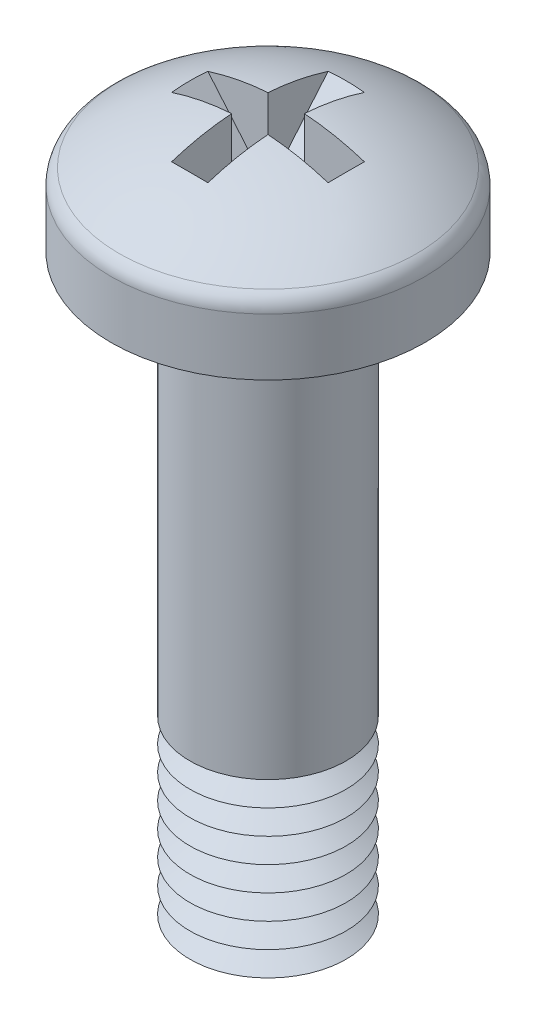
ISO-10303-21;
HEADER;
FILE_DESCRIPTION(('STEP AP214'),'2;1');
FILE_NAME('part.step','',(''),(''),'','','');
FILE_SCHEMA(('AUTOMOTIVE_DESIGN { 1 0 10303 214 1 1 1 1 }'));
ENDSEC;
DATA;
#1=APPLICATION_CONTEXT('core data for automotive mechanical design processes');
#2=APPLICATION_PROTOCOL_DEFINITION('international standard','automotive_design',2000,#1);
#3=PRODUCT_CONTEXT('',#1,'mechanical');
#4=PRODUCT('Part','Part','',(#3));
#5=PRODUCT_RELATED_PRODUCT_CATEGORY('part','',(#4));
#6=PRODUCT_DEFINITION_FORMATION('','',#4);
#7=PRODUCT_DEFINITION_CONTEXT('part definition',#1,'design');
#8=PRODUCT_DEFINITION('design','',#6,#7);
#9=PRODUCT_DEFINITION_SHAPE('','',#8);
#10=(LENGTH_UNIT() NAMED_UNIT(*) SI_UNIT(.MILLI.,.METRE.));
#11=(NAMED_UNIT(*) PLANE_ANGLE_UNIT() SI_UNIT($,.RADIAN.));
#12=(NAMED_UNIT(*) SI_UNIT($,.STERADIAN.) SOLID_ANGLE_UNIT());
#13=UNCERTAINTY_MEASURE_WITH_UNIT(LENGTH_MEASURE(1.E-05),#10,'distance_accuracy_value','');
#14=(GEOMETRIC_REPRESENTATION_CONTEXT(3) GLOBAL_UNCERTAINTY_ASSIGNED_CONTEXT((#13)) GLOBAL_UNIT_ASSIGNED_CONTEXT((#10,
#11,#12)) REPRESENTATION_CONTEXT('',''));
#15=CARTESIAN_POINT('',(0.,0.,0.));
#16=DIRECTION('',(0.,0.,1.));
#17=DIRECTION('',(1.,0.,0.));
#18=AXIS2_PLACEMENT_3D('',#15,#16,#17);
#19=CARTESIAN_POINT('',(2.285,3.1,-0.465));
#20=DIRECTION('',(0.76333266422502,-0.646005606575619,0.));
#21=DIRECTION('',(0.646005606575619,0.76333266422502,0.));
#22=AXIS2_PLACEMENT_3D('',#19,#20,#21);
#23=PLANE('',#22);
#24=DIRECTION('',(0.,0.,-1.));
#25=VECTOR('',#24,1.);
#26=CARTESIAN_POINT('',(0.465,0.94945295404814,-0.465));
#27=LINE('',#26,#25);
#28=CARTESIAN_POINT('',(0.465,0.94945295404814,0.465));
#29=VERTEX_POINT('',#28);
#30=CARTESIAN_POINT('',(0.465,0.94945295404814,-0.465));
#31=VERTEX_POINT('',#30);
#32=EDGE_CURVE('E137',#29,#31,#27,.T.);
#33=ORIENTED_EDGE('',*,*,#32,.F.);
#34=DIRECTION('',(0.646005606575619,0.76333266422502,0.));
#35=VECTOR('',#34,1.);
#36=CARTESIAN_POINT('',(2.285,3.1,0.465));
#37=LINE('',#36,#35);
#38=CARTESIAN_POINT('',(2.00334390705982,2.76718973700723,0.465));
#39=VERTEX_POINT('',#38);
#40=EDGE_CURVE('E178',#29,#39,#37,.T.);
#41=ORIENTED_EDGE('',*,*,#40,.T.);
#42=CARTESIAN_POINT('',(-1.8840992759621,-1.82628798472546,0.));
#43=DIRECTION('',(0.76333266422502,-0.646005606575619,0.));
#44=DIRECTION('',(0.646005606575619,0.76333266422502,0.));
#45=AXIS2_PLACEMENT_3D('',#42,#43,#44);
#46=CIRCLE('',#45,6.03560080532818);
#47=CARTESIAN_POINT('',(2.00334390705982,2.76718973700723,-0.465));
#48=VERTEX_POINT('',#47);
#49=EDGE_CURVE('E259',#39,#48,#46,.F.);
#50=ORIENTED_EDGE('',*,*,#49,.T.);
#51=DIRECTION('',(0.646005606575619,0.76333266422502,0.));
#52=VECTOR('',#51,1.);
#53=CARTESIAN_POINT('',(2.285,3.1,-0.465));
#54=LINE('',#53,#52);
#55=EDGE_CURVE('E184',#31,#48,#54,.T.);
#56=ORIENTED_EDGE('',*,*,#55,.F.);
#57=EDGE_LOOP('',(#33,#41,#50,#56));
#58=FACE_BOUND('',#57,.T.);
#59=ADVANCED_FACE('F31',(#58),#23,.F.);
#60=CARTESIAN_POINT('',(-2.285,4.65,-0.465));
#61=DIRECTION('',(0.,0.,-1.));
#62=DIRECTION('',(-1.,0.,0.));
#63=AXIS2_PLACEMENT_3D('',#60,#61,#62);
#64=PLANE('',#63);
#65=DIRECTION('',(0.646005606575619,-0.76333266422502,0.));
#66=VECTOR('',#65,1.);
#67=CARTESIAN_POINT('',(0.,0.4,-0.465));
#68=LINE('',#67,#66);
#69=CARTESIAN_POINT('',(-2.00334390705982,2.76718973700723,-0.465));
#70=VERTEX_POINT('',#69);
#71=CARTESIAN_POINT('',(-0.465,0.94945295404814,-0.465));
#72=VERTEX_POINT('',#71);
#73=EDGE_CURVE('E182',#70,#72,#68,.T.);
#74=ORIENTED_EDGE('',*,*,#73,.T.);
#75=DIRECTION('',(0.,1.,0.));
#76=VECTOR('',#75,1.);
#77=CARTESIAN_POINT('',(-0.465,4.65,-0.465));
#78=LINE('',#77,#76);
#79=CARTESIAN_POINT('',(-0.465,3.06675595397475,-0.465));
#80=VERTEX_POINT('',#79);
#81=EDGE_CURVE('E158',#72,#80,#78,.T.);
#82=ORIENTED_EDGE('',*,*,#81,.T.);
#83=CARTESIAN_POINT('',(0.,-3.42079422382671,-0.465));
#84=DIRECTION('',(0.,0.,-1.));
#85=DIRECTION('',(-1.,0.,0.));
#86=AXIS2_PLACEMENT_3D('',#83,#84,#85);
#87=CIRCLE('',#86,6.50419344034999);
#88=EDGE_CURVE('E262',#80,#70,#87,.F.);
#89=ORIENTED_EDGE('',*,*,#88,.T.);
#90=EDGE_LOOP('',(#74,#82,#89));
#91=FACE_BOUND('',#90,.T.);
#92=ADVANCED_FACE('F290',(#91),#64,.F.);
#93=DIRECTION('',(0.,1.,0.));
#94=VECTOR('',#93,1.);
#95=CARTESIAN_POINT('',(0.465,4.65,-0.465));
#96=LINE('',#95,#94);
#97=CARTESIAN_POINT('',(0.465,3.06675595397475,-0.465));
#98=VERTEX_POINT('',#97);
#99=EDGE_CURVE('E150',#31,#98,#96,.T.);
#100=ORIENTED_EDGE('',*,*,#99,.F.);
#101=ORIENTED_EDGE('',*,*,#55,.T.);
#102=EDGE_CURVE('E263',#48,#98,#87,.F.);
#103=ORIENTED_EDGE('',*,*,#102,.T.);
#104=EDGE_LOOP('',(#100,#101,#103));
#105=FACE_BOUND('',#104,.T.);
#106=ADVANCED_FACE('F318',(#105),#64,.F.);
#107=CARTESIAN_POINT('',(-2.285,4.65,0.465));
#108=DIRECTION('',(0.,0.,-1.));
#109=DIRECTION('',(-1.,0.,0.));
#110=AXIS2_PLACEMENT_3D('',#107,#108,#109);
#111=PLANE('',#110);
#112=DIRECTION('',(0.,1.,0.));
#113=VECTOR('',#112,1.);
#114=CARTESIAN_POINT('',(-0.465,4.65,0.465));
#115=LINE('',#114,#113);
#116=CARTESIAN_POINT('',(-0.465,0.94945295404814,0.465));
#117=VERTEX_POINT('',#116);
#118=CARTESIAN_POINT('',(-0.465,3.06675595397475,0.465));
#119=VERTEX_POINT('',#118);
#120=EDGE_CURVE('E39',#117,#119,#115,.T.);
#121=ORIENTED_EDGE('',*,*,#120,.F.);
#122=DIRECTION('',(0.646005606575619,-0.76333266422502,0.));
#123=VECTOR('',#122,1.);
#124=CARTESIAN_POINT('',(0.,0.4,0.465));
#125=LINE('',#124,#123);
#126=CARTESIAN_POINT('',(-2.00334390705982,2.76718973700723,0.465));
#127=VERTEX_POINT('',#126);
#128=EDGE_CURVE('E175',#127,#117,#125,.T.);
#129=ORIENTED_EDGE('',*,*,#128,.F.);
#130=CARTESIAN_POINT('',(0.,-3.42079422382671,0.465));
#131=DIRECTION('',(0.,0.,-1.));
#132=DIRECTION('',(-1.,0.,0.));
#133=AXIS2_PLACEMENT_3D('',#130,#131,#132);
#134=CIRCLE('',#133,6.50419344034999);
#135=EDGE_CURVE('E196',#119,#127,#134,.F.);
#136=ORIENTED_EDGE('',*,*,#135,.F.);
#137=EDGE_LOOP('',(#121,#129,#136));
#138=FACE_BOUND('',#137,.T.);
#139=ADVANCED_FACE('F282',(#138),#111,.T.);
#140=ORIENTED_EDGE('',*,*,#40,.F.);
#141=DIRECTION('',(0.,1.,0.));
#142=VECTOR('',#141,1.);
#143=CARTESIAN_POINT('',(0.465,4.65,0.465));
#144=LINE('',#143,#142);
#145=CARTESIAN_POINT('',(0.465,3.06675595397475,0.465));
#146=VERTEX_POINT('',#145);
#147=EDGE_CURVE('E266',#29,#146,#144,.T.);
#148=ORIENTED_EDGE('',*,*,#147,.T.);
#149=EDGE_CURVE('E253',#39,#146,#134,.F.);
#150=ORIENTED_EDGE('',*,*,#149,.F.);
#151=EDGE_LOOP('',(#140,#148,#150));
#152=FACE_BOUND('',#151,.T.);
#153=ADVANCED_FACE('F323',(#152),#111,.T.);
#154=CARTESIAN_POINT('',(0.,0.,0.));
#155=DIRECTION('',(0.,-1.,0.));
#156=DIRECTION('',(0.,0.,-1.));
#157=AXIS2_PLACEMENT_3D('',#154,#155,#156);
#158=PLANE('',#157);
#159=CARTESIAN_POINT('',(0.,0.,0.));
#160=DIRECTION('',(0.,-1.,0.));
#161=DIRECTION('',(0.,0.,-1.));
#162=AXIS2_PLACEMENT_3D('',#159,#160,#161);
#163=CIRCLE('',#162,2.);
#164=CARTESIAN_POINT('',(0.,0.,-2.));
#165=VERTEX_POINT('',#164);
#166=EDGE_CURVE('E193',#165,#165,#163,.T.);
#167=ORIENTED_EDGE('',*,*,#166,.F.);
#168=EDGE_LOOP('',(#167));
#169=FACE_BOUND('',#168,.T.);
#170=CARTESIAN_POINT('',(0.,0.,0.));
#171=DIRECTION('',(0.,-1.,0.));
#172=DIRECTION('',(0.,0.,-1.));
#173=AXIS2_PLACEMENT_3D('',#170,#171,#172);
#174=CIRCLE('',#173,4.02079422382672);
#175=CARTESIAN_POINT('',(0.,0.,-4.02079422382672));
#176=VERTEX_POINT('',#175);
#177=EDGE_CURVE('E197',#176,#176,#174,.T.);
#178=ORIENTED_EDGE('',*,*,#177,.T.);
#179=EDGE_LOOP('',(#178));
#180=FACE_BOUND('',#179,.T.);
#181=ADVANCED_FACE('F33',(#169,#180),#158,.T.);
#182=CARTESIAN_POINT('',(0.,0.,0.));
#183=DIRECTION('',(0.,-1.,0.));
#184=DIRECTION('',(0.,0.,-1.));
#185=AXIS2_PLACEMENT_3D('',#182,#183,#184);
#186=CYLINDRICAL_SURFACE('',#185,4.02079422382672);
#187=CARTESIAN_POINT('',(0.,1.4628519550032,0.));
#188=DIRECTION('',(0.,-1.,0.));
#189=DIRECTION('',(0.,0.,-1.));
#190=AXIS2_PLACEMENT_3D('',#187,#188,#189);
#191=CIRCLE('',#190,4.02079422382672);
#192=CARTESIAN_POINT('',(0.,1.4628519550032,-4.02079422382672));
#193=VERTEX_POINT('',#192);
#194=EDGE_CURVE('E248',#193,#193,#191,.T.);
#195=ORIENTED_EDGE('',*,*,#194,.T.);
#196=EDGE_LOOP('',(#195));
#197=FACE_BOUND('',#196,.T.);
#198=ORIENTED_EDGE('',*,*,#177,.F.);
#199=EDGE_LOOP('',(#198));
#200=FACE_BOUND('',#199,.T.);
#201=ADVANCED_FACE('F454',(#197,#200),#186,.T.);
#202=CARTESIAN_POINT('',(0.,1.4628519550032,0.));
#203=DIRECTION('',(0.,-1.,0.));
#204=DIRECTION('',(0.,0.,-1.));
#205=AXIS2_PLACEMENT_3D('',#202,#203,#204);
#206=TOROIDAL_SURFACE('',#205,3.52,0.500794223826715);
#207=CARTESIAN_POINT('',(0.,1.86911471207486,0.));
#208=DIRECTION('',(0.,-1.,0.));
#209=DIRECTION('',(0.,0.,-1.));
#210=AXIS2_PLACEMENT_3D('',#207,#208,#209);
#211=CIRCLE('',#210,3.81282320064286);
#212=CARTESIAN_POINT('',(0.,1.86911471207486,-3.81282320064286));
#213=VERTEX_POINT('',#212);
#214=EDGE_CURVE('E245',#213,#213,#211,.T.);
#215=ORIENTED_EDGE('',*,*,#214,.T.);
#216=EDGE_LOOP('',(#215));
#217=FACE_BOUND('',#216,.T.);
#218=ORIENTED_EDGE('',*,*,#194,.F.);
#219=EDGE_LOOP('',(#218));
#220=FACE_BOUND('',#219,.T.);
#221=ADVANCED_FACE('F452',(#217,#220),#206,.T.);
#222=CARTESIAN_POINT('',(0.,-3.42079422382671,0.));
#223=DIRECTION('',(0.,0.,1.));
#224=DIRECTION('',(1.,0.,0.));
#225=AXIS2_PLACEMENT_3D('',#222,#223,#224);
#226=SPHERICAL_SURFACE('',#225,6.52079422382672);
#227=CARTESIAN_POINT('',(-0.465,-3.42079422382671,0.));
#228=DIRECTION('',(-1.,0.,0.));
#229=DIRECTION('',(0.,0.,1.));
#230=AXIS2_PLACEMENT_3D('',#227,#228,#229);
#231=CIRCLE('',#230,6.50419344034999);
#232=CARTESIAN_POINT('',(-0.465,2.76718973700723,-2.00334390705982));
#233=VERTEX_POINT('',#232);
#234=EDGE_CURVE('E159',#233,#80,#231,.F.);
#235=ORIENTED_EDGE('',*,*,#234,.F.);
#236=CARTESIAN_POINT('',(0.,-1.82628798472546,1.8840992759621));
#237=DIRECTION('',(0.,-0.646005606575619,-0.76333266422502));
#238=DIRECTION('',(0.,0.76333266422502,-0.646005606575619));
#239=AXIS2_PLACEMENT_3D('',#236,#237,#238);
#240=CIRCLE('',#239,6.03560080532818);
#241=CARTESIAN_POINT('',(0.465,2.76718973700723,-2.00334390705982));
#242=VERTEX_POINT('',#241);
#243=EDGE_CURVE('E172',#242,#233,#240,.F.);
#244=ORIENTED_EDGE('',*,*,#243,.F.);
#245=CARTESIAN_POINT('',(0.465,-3.42079422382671,0.));
#246=DIRECTION('',(-1.,0.,0.));
#247=DIRECTION('',(0.,0.,1.));
#248=AXIS2_PLACEMENT_3D('',#245,#246,#247);
#249=CIRCLE('',#248,6.50419344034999);
#250=EDGE_CURVE('E151',#242,#98,#249,.F.);
#251=ORIENTED_EDGE('',*,*,#250,.T.);
#252=ORIENTED_EDGE('',*,*,#102,.F.);
#253=ORIENTED_EDGE('',*,*,#49,.F.);
#254=ORIENTED_EDGE('',*,*,#149,.T.);
#255=CARTESIAN_POINT('',(0.465,2.76718973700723,2.00334390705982));
#256=VERTEX_POINT('',#255);
#257=EDGE_CURVE('E147',#146,#256,#249,.F.);
#258=ORIENTED_EDGE('',*,*,#257,.T.);
#259=CARTESIAN_POINT('',(0.,-1.82628798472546,-1.8840992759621));
#260=DIRECTION('',(0.,-0.646005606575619,0.76333266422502));
#261=DIRECTION('',(0.,-0.76333266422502,-0.646005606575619));
#262=AXIS2_PLACEMENT_3D('',#259,#260,#261);
#263=CIRCLE('',#262,6.03560080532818);
#264=CARTESIAN_POINT('',(-0.465,2.76718973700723,2.00334390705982));
#265=VERTEX_POINT('',#264);
#266=EDGE_CURVE('E166',#265,#256,#263,.F.);
#267=ORIENTED_EDGE('',*,*,#266,.F.);
#268=EDGE_CURVE('E156',#119,#265,#231,.F.);
#269=ORIENTED_EDGE('',*,*,#268,.F.);
#270=ORIENTED_EDGE('',*,*,#135,.T.);
#271=CARTESIAN_POINT('',(1.8840992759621,-1.82628798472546,0.));
#272=DIRECTION('',(-0.76333266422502,-0.646005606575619,0.));
#273=DIRECTION('',(0.646005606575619,-0.76333266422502,0.));
#274=AXIS2_PLACEMENT_3D('',#271,#272,#273);
#275=CIRCLE('',#274,6.03560080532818);
#276=EDGE_CURVE('E256',#70,#127,#275,.F.);
#277=ORIENTED_EDGE('',*,*,#276,.F.);
#278=ORIENTED_EDGE('',*,*,#88,.F.);
#279=EDGE_LOOP('',(#235,#244,#251,#252,#253,#254,#258,#267,#269,#270,#277,#278));
#280=FACE_BOUND('',#279,.T.);
#281=ORIENTED_EDGE('',*,*,#214,.F.);
#282=EDGE_LOOP('',(#281));
#283=FACE_BOUND('',#282,.T.);
#284=ADVANCED_FACE('F279',(#280,#283),#226,.T.);
#285=CARTESIAN_POINT('',(0.,-15.,0.));
#286=DIRECTION('',(0.,-1.,0.));
#287=DIRECTION('',(0.,0.,-1.));
#288=AXIS2_PLACEMENT_3D('',#285,#286,#287);
#289=PLANE('',#288);
#290=CARTESIAN_POINT('',(0.,-15.,0.));
#291=DIRECTION('',(0.,-1.,0.));
#292=DIRECTION('',(0.,0.,-1.));
#293=AXIS2_PLACEMENT_3D('',#290,#291,#292);
#294=CIRCLE('',#293,1.45595);
#295=CARTESIAN_POINT('',(0.,-15.,-1.45595));
#296=VERTEX_POINT('',#295);
#297=EDGE_CURVE('E242',#296,#296,#294,.T.);
#298=ORIENTED_EDGE('',*,*,#297,.T.);
#299=EDGE_LOOP('',(#298));
#300=FACE_BOUND('',#299,.T.);
#301=ADVANCED_FACE('F445',(#300),#289,.T.);
#302=CARTESIAN_POINT('',(0.,-15.,0.));
#303=DIRECTION('',(0.,1.,0.));
#304=DIRECTION('',(0.,0.,1.));
#305=AXIS2_PLACEMENT_3D('',#302,#303,#304);
#306=CONICAL_SURFACE('',#305,1.45595,1.0471975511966);
#307=CARTESIAN_POINT('',(0.,-14.6858925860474,0.));
#308=DIRECTION('',(0.,-1.,0.));
#309=DIRECTION('',(0.,0.,-1.));
#310=AXIS2_PLACEMENT_3D('',#307,#308,#309);
#311=CIRCLE('',#310,2.);
#312=CARTESIAN_POINT('',(0.,-14.6858925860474,-2.));
#313=VERTEX_POINT('',#312);
#314=EDGE_CURVE('E239',#313,#313,#311,.T.);
#315=ORIENTED_EDGE('',*,*,#314,.T.);
#316=EDGE_LOOP('',(#315));
#317=FACE_BOUND('',#316,.T.);
#318=ORIENTED_EDGE('',*,*,#297,.F.);
#319=EDGE_LOOP('',(#318));
#320=FACE_BOUND('',#319,.T.);
#321=ADVANCED_FACE('F441',(#317,#320),#306,.T.);
#322=CARTESIAN_POINT('',(0.,-14.6858925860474,0.));
#323=DIRECTION('',(0.,-1.,0.));
#324=DIRECTION('',(0.,0.,-1.));
#325=AXIS2_PLACEMENT_3D('',#322,#323,#324);
#326=CONICAL_SURFACE('',#325,2.,1.0471975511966);
#327=CARTESIAN_POINT('',(0.,-14.3717851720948,0.));
#328=DIRECTION('',(0.,-1.,0.));
#329=DIRECTION('',(0.,0.,-1.));
#330=AXIS2_PLACEMENT_3D('',#327,#328,#329);
#331=CIRCLE('',#330,1.45595);
#332=CARTESIAN_POINT('',(0.,-14.3717851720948,-1.45595));
#333=VERTEX_POINT('',#332);
#334=EDGE_CURVE('E236',#333,#333,#331,.T.);
#335=ORIENTED_EDGE('',*,*,#334,.T.);
#336=EDGE_LOOP('',(#335));
#337=FACE_BOUND('',#336,.T.);
#338=ORIENTED_EDGE('',*,*,#314,.F.);
#339=EDGE_LOOP('',(#338));
#340=FACE_BOUND('',#339,.T.);
#341=ADVANCED_FACE('F437',(#337,#340),#326,.T.);
#342=CARTESIAN_POINT('',(0.,-14.3717851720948,0.));
#343=DIRECTION('',(0.,1.,0.));
#344=DIRECTION('',(0.,0.,1.));
#345=AXIS2_PLACEMENT_3D('',#342,#343,#344);
#346=CONICAL_SURFACE('',#345,1.45595,1.0471975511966);
#347=CARTESIAN_POINT('',(0.,-14.0576777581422,0.));
#348=DIRECTION('',(0.,-1.,0.));
#349=DIRECTION('',(0.,0.,-1.));
#350=AXIS2_PLACEMENT_3D('',#347,#348,#349);
#351=CIRCLE('',#350,2.);
#352=CARTESIAN_POINT('',(0.,-14.0576777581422,-2.));
#353=VERTEX_POINT('',#352);
#354=EDGE_CURVE('E233',#353,#353,#351,.T.);
#355=ORIENTED_EDGE('',*,*,#354,.T.);
#356=EDGE_LOOP('',(#355));
#357=FACE_BOUND('',#356,.T.);
#358=ORIENTED_EDGE('',*,*,#334,.F.);
#359=EDGE_LOOP('',(#358));
#360=FACE_BOUND('',#359,.T.);
#361=ADVANCED_FACE('F433',(#357,#360),#346,.T.);
#362=CARTESIAN_POINT('',(0.,-14.0576777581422,0.));
#363=DIRECTION('',(0.,-1.,0.));
#364=DIRECTION('',(0.,0.,-1.));
#365=AXIS2_PLACEMENT_3D('',#362,#363,#364);
#366=CONICAL_SURFACE('',#365,2.,1.0471975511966);
#367=CARTESIAN_POINT('',(0.,-13.7435703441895,0.));
#368=DIRECTION('',(0.,-1.,0.));
#369=DIRECTION('',(0.,0.,-1.));
#370=AXIS2_PLACEMENT_3D('',#367,#368,#369);
#371=CIRCLE('',#370,1.45595);
#372=CARTESIAN_POINT('',(0.,-13.7435703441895,-1.45595));
#373=VERTEX_POINT('',#372);
#374=EDGE_CURVE('E230',#373,#373,#371,.T.);
#375=ORIENTED_EDGE('',*,*,#374,.T.);
#376=EDGE_LOOP('',(#375));
#377=FACE_BOUND('',#376,.T.);
#378=ORIENTED_EDGE('',*,*,#354,.F.);
#379=EDGE_LOOP('',(#378));
#380=FACE_BOUND('',#379,.T.);
#381=ADVANCED_FACE('F429',(#377,#380),#366,.T.);
#382=CARTESIAN_POINT('',(0.,-13.7435703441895,0.));
#383=DIRECTION('',(0.,1.,0.));
#384=DIRECTION('',(0.,0.,1.));
#385=AXIS2_PLACEMENT_3D('',#382,#383,#384);
#386=CONICAL_SURFACE('',#385,1.45595,1.0471975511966);
#387=CARTESIAN_POINT('',(0.,-13.4294629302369,0.));
#388=DIRECTION('',(0.,-1.,0.));
#389=DIRECTION('',(0.,0.,-1.));
#390=AXIS2_PLACEMENT_3D('',#387,#388,#389);
#391=CIRCLE('',#390,2.);
#392=CARTESIAN_POINT('',(0.,-13.4294629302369,-2.));
#393=VERTEX_POINT('',#392);
#394=EDGE_CURVE('E227',#393,#393,#391,.T.);
#395=ORIENTED_EDGE('',*,*,#394,.T.);
#396=EDGE_LOOP('',(#395));
#397=FACE_BOUND('',#396,.T.);
#398=ORIENTED_EDGE('',*,*,#374,.F.);
#399=EDGE_LOOP('',(#398));
#400=FACE_BOUND('',#399,.T.);
#401=ADVANCED_FACE('F425',(#397,#400),#386,.T.);
#402=CARTESIAN_POINT('',(0.,-13.4294629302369,0.));
#403=DIRECTION('',(0.,-1.,0.));
#404=DIRECTION('',(0.,0.,-1.));
#405=AXIS2_PLACEMENT_3D('',#402,#403,#404);
#406=CONICAL_SURFACE('',#405,2.,1.0471975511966);
#407=CARTESIAN_POINT('',(0.,-13.1153555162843,0.));
#408=DIRECTION('',(0.,-1.,0.));
#409=DIRECTION('',(0.,0.,-1.));
#410=AXIS2_PLACEMENT_3D('',#407,#408,#409);
#411=CIRCLE('',#410,1.45595);
#412=CARTESIAN_POINT('',(0.,-13.1153555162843,-1.45595));
#413=VERTEX_POINT('',#412);
#414=EDGE_CURVE('E224',#413,#413,#411,.T.);
#415=ORIENTED_EDGE('',*,*,#414,.T.);
#416=EDGE_LOOP('',(#415));
#417=FACE_BOUND('',#416,.T.);
#418=ORIENTED_EDGE('',*,*,#394,.F.);
#419=EDGE_LOOP('',(#418));
#420=FACE_BOUND('',#419,.T.);
#421=ADVANCED_FACE('F421',(#417,#420),#406,.T.);
#422=CARTESIAN_POINT('',(0.,-13.1153555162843,0.));
#423=DIRECTION('',(0.,1.,0.));
#424=DIRECTION('',(0.,0.,1.));
#425=AXIS2_PLACEMENT_3D('',#422,#423,#424);
#426=CONICAL_SURFACE('',#425,1.45595,1.0471975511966);
#427=CARTESIAN_POINT('',(0.,-12.8012481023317,0.));
#428=DIRECTION('',(0.,-1.,0.));
#429=DIRECTION('',(0.,0.,-1.));
#430=AXIS2_PLACEMENT_3D('',#427,#428,#429);
#431=CIRCLE('',#430,2.);
#432=CARTESIAN_POINT('',(0.,-12.8012481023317,-2.));
#433=VERTEX_POINT('',#432);
#434=EDGE_CURVE('E221',#433,#433,#431,.T.);
#435=ORIENTED_EDGE('',*,*,#434,.T.);
#436=EDGE_LOOP('',(#435));
#437=FACE_BOUND('',#436,.T.);
#438=ORIENTED_EDGE('',*,*,#414,.F.);
#439=EDGE_LOOP('',(#438));
#440=FACE_BOUND('',#439,.T.);
#441=ADVANCED_FACE('F417',(#437,#440),#426,.T.);
#442=CARTESIAN_POINT('',(0.,-12.8012481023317,0.));
#443=DIRECTION('',(0.,-1.,0.));
#444=DIRECTION('',(0.,0.,-1.));
#445=AXIS2_PLACEMENT_3D('',#442,#443,#444);
#446=CONICAL_SURFACE('',#445,2.,1.0471975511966);
#447=CARTESIAN_POINT('',(0.,-12.4871406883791,0.));
#448=DIRECTION('',(0.,-1.,0.));
#449=DIRECTION('',(0.,0.,-1.));
#450=AXIS2_PLACEMENT_3D('',#447,#448,#449);
#451=CIRCLE('',#450,1.45595);
#452=CARTESIAN_POINT('',(0.,-12.4871406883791,-1.45595));
#453=VERTEX_POINT('',#452);
#454=EDGE_CURVE('E218',#453,#453,#451,.T.);
#455=ORIENTED_EDGE('',*,*,#454,.T.);
#456=EDGE_LOOP('',(#455));
#457=FACE_BOUND('',#456,.T.);
#458=ORIENTED_EDGE('',*,*,#434,.F.);
#459=EDGE_LOOP('',(#458));
#460=FACE_BOUND('',#459,.T.);
#461=ADVANCED_FACE('F413',(#457,#460),#446,.T.);
#462=CARTESIAN_POINT('',(0.,-12.4871406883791,0.));
#463=DIRECTION('',(0.,1.,0.));
#464=DIRECTION('',(0.,0.,1.));
#465=AXIS2_PLACEMENT_3D('',#462,#463,#464);
#466=CONICAL_SURFACE('',#465,1.45595,1.0471975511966);
#467=CARTESIAN_POINT('',(0.,-12.1730332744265,0.));
#468=DIRECTION('',(0.,-1.,0.));
#469=DIRECTION('',(0.,0.,-1.));
#470=AXIS2_PLACEMENT_3D('',#467,#468,#469);
#471=CIRCLE('',#470,2.);
#472=CARTESIAN_POINT('',(0.,-12.1730332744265,-2.));
#473=VERTEX_POINT('',#472);
#474=EDGE_CURVE('E215',#473,#473,#471,.T.);
#475=ORIENTED_EDGE('',*,*,#474,.T.);
#476=EDGE_LOOP('',(#475));
#477=FACE_BOUND('',#476,.T.);
#478=ORIENTED_EDGE('',*,*,#454,.F.);
#479=EDGE_LOOP('',(#478));
#480=FACE_BOUND('',#479,.T.);
#481=ADVANCED_FACE('F409',(#477,#480),#466,.T.);
#482=CARTESIAN_POINT('',(0.,-12.1730332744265,0.));
#483=DIRECTION('',(0.,-1.,0.));
#484=DIRECTION('',(0.,0.,-1.));
#485=AXIS2_PLACEMENT_3D('',#482,#483,#484);
#486=CONICAL_SURFACE('',#485,2.,1.0471975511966);
#487=CARTESIAN_POINT('',(0.,-11.8589258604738,0.));
#488=DIRECTION('',(0.,-1.,0.));
#489=DIRECTION('',(0.,0.,-1.));
#490=AXIS2_PLACEMENT_3D('',#487,#488,#489);
#491=CIRCLE('',#490,1.45595);
#492=CARTESIAN_POINT('',(0.,-11.8589258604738,-1.45595));
#493=VERTEX_POINT('',#492);
#494=EDGE_CURVE('E212',#493,#493,#491,.T.);
#495=ORIENTED_EDGE('',*,*,#494,.T.);
#496=EDGE_LOOP('',(#495));
#497=FACE_BOUND('',#496,.T.);
#498=ORIENTED_EDGE('',*,*,#474,.F.);
#499=EDGE_LOOP('',(#498));
#500=FACE_BOUND('',#499,.T.);
#501=ADVANCED_FACE('F405',(#497,#500),#486,.T.);
#502=CARTESIAN_POINT('',(0.,-11.8589258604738,0.));
#503=DIRECTION('',(0.,1.,0.));
#504=DIRECTION('',(0.,0.,1.));
#505=AXIS2_PLACEMENT_3D('',#502,#503,#504);
#506=CONICAL_SURFACE('',#505,1.45595,1.0471975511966);
#507=CARTESIAN_POINT('',(0.,-11.5448184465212,0.));
#508=DIRECTION('',(0.,-1.,0.));
#509=DIRECTION('',(0.,0.,-1.));
#510=AXIS2_PLACEMENT_3D('',#507,#508,#509);
#511=CIRCLE('',#510,2.);
#512=CARTESIAN_POINT('',(0.,-11.5448184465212,-2.));
#513=VERTEX_POINT('',#512);
#514=EDGE_CURVE('E209',#513,#513,#511,.T.);
#515=ORIENTED_EDGE('',*,*,#514,.T.);
#516=EDGE_LOOP('',(#515));
#517=FACE_BOUND('',#516,.T.);
#518=ORIENTED_EDGE('',*,*,#494,.F.);
#519=EDGE_LOOP('',(#518));
#520=FACE_BOUND('',#519,.T.);
#521=ADVANCED_FACE('F401',(#517,#520),#506,.T.);
#522=CARTESIAN_POINT('',(0.,-11.5448184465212,0.));
#523=DIRECTION('',(0.,-1.,0.));
#524=DIRECTION('',(0.,0.,-1.));
#525=AXIS2_PLACEMENT_3D('',#522,#523,#524);
#526=CONICAL_SURFACE('',#525,2.,1.0471975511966);
#527=CARTESIAN_POINT('',(0.,-11.2307110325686,0.));
#528=DIRECTION('',(0.,-1.,0.));
#529=DIRECTION('',(0.,0.,-1.));
#530=AXIS2_PLACEMENT_3D('',#527,#528,#529);
#531=CIRCLE('',#530,1.45595);
#532=CARTESIAN_POINT('',(0.,-11.2307110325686,-1.45595));
#533=VERTEX_POINT('',#532);
#534=EDGE_CURVE('E206',#533,#533,#531,.T.);
#535=ORIENTED_EDGE('',*,*,#534,.T.);
#536=EDGE_LOOP('',(#535));
#537=FACE_BOUND('',#536,.T.);
#538=ORIENTED_EDGE('',*,*,#514,.F.);
#539=EDGE_LOOP('',(#538));
#540=FACE_BOUND('',#539,.T.);
#541=ADVANCED_FACE('F397',(#537,#540),#526,.T.);
#542=CARTESIAN_POINT('',(0.,-11.2307110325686,0.));
#543=DIRECTION('',(0.,1.,0.));
#544=DIRECTION('',(0.,0.,1.));
#545=AXIS2_PLACEMENT_3D('',#542,#543,#544);
#546=CONICAL_SURFACE('',#545,1.45595,1.0471975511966);
#547=CARTESIAN_POINT('',(0.,-10.916603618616,0.));
#548=DIRECTION('',(0.,-1.,0.));
#549=DIRECTION('',(0.,0.,-1.));
#550=AXIS2_PLACEMENT_3D('',#547,#548,#549);
#551=CIRCLE('',#550,2.);
#552=CARTESIAN_POINT('',(0.,-10.916603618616,-2.));
#553=VERTEX_POINT('',#552);
#554=EDGE_CURVE('E203',#553,#553,#551,.T.);
#555=ORIENTED_EDGE('',*,*,#554,.T.);
#556=EDGE_LOOP('',(#555));
#557=FACE_BOUND('',#556,.T.);
#558=ORIENTED_EDGE('',*,*,#534,.F.);
#559=EDGE_LOOP('',(#558));
#560=FACE_BOUND('',#559,.T.);
#561=ADVANCED_FACE('F393',(#557,#560),#546,.T.);
#562=CARTESIAN_POINT('',(0.,-10.916603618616,0.));
#563=DIRECTION('',(0.,-1.,0.));
#564=DIRECTION('',(0.,0.,-1.));
#565=AXIS2_PLACEMENT_3D('',#562,#563,#564);
#566=CONICAL_SURFACE('',#565,2.,1.0471975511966);
#567=CARTESIAN_POINT('',(0.,-10.6024962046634,0.));
#568=DIRECTION('',(0.,-1.,0.));
#569=DIRECTION('',(0.,0.,-1.));
#570=AXIS2_PLACEMENT_3D('',#567,#568,#569);
#571=CIRCLE('',#570,1.45595);
#572=CARTESIAN_POINT('',(0.,-10.6024962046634,-1.45595));
#573=VERTEX_POINT('',#572);
#574=EDGE_CURVE('E200',#573,#573,#571,.T.);
#575=ORIENTED_EDGE('',*,*,#574,.T.);
#576=EDGE_LOOP('',(#575));
#577=FACE_BOUND('',#576,.T.);
#578=ORIENTED_EDGE('',*,*,#554,.F.);
#579=EDGE_LOOP('',(#578));
#580=FACE_BOUND('',#579,.T.);
#581=ADVANCED_FACE('F386',(#577,#580),#566,.T.);
#582=CARTESIAN_POINT('',(0.,-10.6024962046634,0.));
#583=DIRECTION('',(0.,1.,0.));
#584=DIRECTION('',(0.,0.,1.));
#585=AXIS2_PLACEMENT_3D('',#582,#583,#584);
#586=CONICAL_SURFACE('',#585,1.45595,1.0471975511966);
#587=CARTESIAN_POINT('',(0.,-10.2883887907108,0.));
#588=DIRECTION('',(0.,-1.,0.));
#589=DIRECTION('',(0.,0.,-1.));
#590=AXIS2_PLACEMENT_3D('',#587,#588,#589);
#591=CIRCLE('',#590,2.);
#592=CARTESIAN_POINT('',(0.,-10.2883887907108,-2.));
#593=VERTEX_POINT('',#592);
#594=EDGE_CURVE('E192',#593,#593,#591,.T.);
#595=ORIENTED_EDGE('',*,*,#594,.T.);
#596=EDGE_LOOP('',(#595));
#597=FACE_BOUND('',#596,.T.);
#598=ORIENTED_EDGE('',*,*,#574,.F.);
#599=EDGE_LOOP('',(#598));
#600=FACE_BOUND('',#599,.T.);
#601=ADVANCED_FACE('F381',(#597,#600),#586,.T.);
#602=CARTESIAN_POINT('',(0.,0.,0.));
#603=DIRECTION('',(0.,-1.,0.));
#604=DIRECTION('',(0.,0.,-1.));
#605=AXIS2_PLACEMENT_3D('',#602,#603,#604);
#606=CYLINDRICAL_SURFACE('',#605,2.);
#607=ORIENTED_EDGE('',*,*,#166,.T.);
#608=EDGE_LOOP('',(#607));
#609=FACE_BOUND('',#608,.T.);
#610=ORIENTED_EDGE('',*,*,#594,.F.);
#611=EDGE_LOOP('',(#610));
#612=FACE_BOUND('',#611,.T.);
#613=ADVANCED_FACE('F374',(#609,#612),#606,.T.);
#614=CARTESIAN_POINT('',(0.,0.4,-0.465));
#615=DIRECTION('',(-0.76333266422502,-0.646005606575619,0.));
#616=DIRECTION('',(0.646005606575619,-0.76333266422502,0.));
#617=AXIS2_PLACEMENT_3D('',#614,#615,#616);
#618=PLANE('',#617);
#619=ORIENTED_EDGE('',*,*,#128,.T.);
#620=DIRECTION('',(0.,0.,-1.));
#621=VECTOR('',#620,1.);
#622=CARTESIAN_POINT('',(-0.465,0.94945295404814,-0.465));
#623=LINE('',#622,#621);
#624=EDGE_CURVE('E153',#117,#72,#623,.T.);
#625=ORIENTED_EDGE('',*,*,#624,.T.);
#626=ORIENTED_EDGE('',*,*,#73,.F.);
#627=ORIENTED_EDGE('',*,*,#276,.T.);
#628=EDGE_LOOP('',(#619,#625,#626,#627));
#629=FACE_BOUND('',#628,.T.);
#630=ADVANCED_FACE('F286',(#629),#618,.F.);
#631=CARTESIAN_POINT('',(0.465,4.65,2.285));
#632=DIRECTION('',(-1.,0.,0.));
#633=DIRECTION('',(0.,0.,1.));
#634=AXIS2_PLACEMENT_3D('',#631,#632,#633);
#635=PLANE('',#634);
#636=ORIENTED_EDGE('',*,*,#147,.F.);
#637=DIRECTION('',(0.,-0.76333266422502,-0.646005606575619));
#638=VECTOR('',#637,1.);
#639=CARTESIAN_POINT('',(0.465,0.4,0.));
#640=LINE('',#639,#638);
#641=EDGE_CURVE('E133',#256,#29,#640,.T.);
#642=ORIENTED_EDGE('',*,*,#641,.F.);
#643=ORIENTED_EDGE('',*,*,#257,.F.);
#644=EDGE_LOOP('',(#636,#642,#643));
#645=FACE_BOUND('',#644,.T.);
#646=ADVANCED_FACE('F327',(#645),#635,.T.);
#647=CARTESIAN_POINT('',(-0.465,4.65,2.285));
#648=DIRECTION('',(-1.,0.,0.));
#649=DIRECTION('',(0.,0.,1.));
#650=AXIS2_PLACEMENT_3D('',#647,#648,#649);
#651=PLANE('',#650);
#652=ORIENTED_EDGE('',*,*,#268,.T.);
#653=DIRECTION('',(0.,-0.76333266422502,-0.646005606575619));
#654=VECTOR('',#653,1.);
#655=CARTESIAN_POINT('',(-0.465,0.4,0.));
#656=LINE('',#655,#654);
#657=EDGE_CURVE('E54',#265,#117,#656,.T.);
#658=ORIENTED_EDGE('',*,*,#657,.T.);
#659=ORIENTED_EDGE('',*,*,#120,.T.);
#660=EDGE_LOOP('',(#652,#658,#659));
#661=FACE_BOUND('',#660,.T.);
#662=ADVANCED_FACE('F272',(#661),#651,.F.);
#663=CARTESIAN_POINT('',(-0.465,0.4,0.));
#664=DIRECTION('',(0.,-0.646005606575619,0.76333266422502));
#665=DIRECTION('',(0.,-0.76333266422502,-0.646005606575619));
#666=AXIS2_PLACEMENT_3D('',#663,#664,#665);
#667=PLANE('',#666);
#668=ORIENTED_EDGE('',*,*,#266,.T.);
#669=ORIENTED_EDGE('',*,*,#641,.T.);
#670=DIRECTION('',(-1.,0.,0.));
#671=VECTOR('',#670,1.);
#672=CARTESIAN_POINT('',(-2.285,0.94945295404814,0.465));
#673=LINE('',#672,#671);
#674=EDGE_CURVE('E269',#29,#117,#673,.T.);
#675=ORIENTED_EDGE('',*,*,#674,.T.);
#676=ORIENTED_EDGE('',*,*,#657,.F.);
#677=EDGE_LOOP('',(#668,#669,#675,#676));
#678=FACE_BOUND('',#677,.T.);
#679=ADVANCED_FACE('F330',(#678),#667,.F.);
#680=ORIENTED_EDGE('',*,*,#674,.F.);
#681=CARTESIAN_POINT('',(0.,0.4,0.465));
#682=VERTEX_POINT('',#681);
#683=EDGE_CURVE('E179',#682,#29,#37,.T.);
#684=ORIENTED_EDGE('',*,*,#683,.F.);
#685=EDGE_CURVE('E174',#117,#682,#125,.T.);
#686=ORIENTED_EDGE('',*,*,#685,.F.);
#687=EDGE_LOOP('',(#680,#684,#686));
#688=FACE_BOUND('',#687,.T.);
#689=ADVANCED_FACE('F334',(#688),#111,.T.);
#690=DIRECTION('',(0.,0.,1.));
#691=VECTOR('',#690,1.);
#692=CARTESIAN_POINT('',(0.,0.4,-0.465));
#693=LINE('',#692,#691);
#694=CARTESIAN_POINT('',(0.,0.4,0.));
#695=VERTEX_POINT('',#694);
#696=EDGE_CURVE('E188',#695,#682,#693,.T.);
#697=ORIENTED_EDGE('',*,*,#696,.F.);
#698=DIRECTION('',(-0.542627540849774,0.641179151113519,0.542627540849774));
#699=VECTOR('',#698,1.);
#700=CARTESIAN_POINT('',(0.136916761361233,0.238216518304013,-0.136916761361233));
#701=LINE('',#700,#699);
#702=EDGE_CURVE('E162',#695,#117,#701,.T.);
#703=ORIENTED_EDGE('',*,*,#702,.T.);
#704=ORIENTED_EDGE('',*,*,#685,.T.);
#705=EDGE_LOOP('',(#697,#703,#704));
#706=FACE_BOUND('',#705,.T.);
#707=ADVANCED_FACE('F338',(#706),#618,.F.);
#708=ORIENTED_EDGE('',*,*,#683,.T.);
#709=DIRECTION('',(-0.542627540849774,-0.641179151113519,-0.542627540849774));
#710=VECTOR('',#709,1.);
#711=CARTESIAN_POINT('',(1.47527721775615,2.14321596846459,1.47527721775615));
#712=LINE('',#711,#710);
#713=EDGE_CURVE('E129',#29,#695,#712,.T.);
#714=ORIENTED_EDGE('',*,*,#713,.T.);
#715=ORIENTED_EDGE('',*,*,#696,.T.);
#716=EDGE_LOOP('',(#708,#714,#715));
#717=FACE_BOUND('',#716,.T.);
#718=ADVANCED_FACE('F355',(#717),#23,.F.);
#719=ORIENTED_EDGE('',*,*,#234,.T.);
#720=ORIENTED_EDGE('',*,*,#81,.F.);
#721=DIRECTION('',(0.,0.76333266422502,-0.646005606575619));
#722=VECTOR('',#721,1.);
#723=CARTESIAN_POINT('',(-0.465,3.1,-2.285));
#724=LINE('',#723,#722);
#725=EDGE_CURVE('E143',#72,#233,#724,.T.);
#726=ORIENTED_EDGE('',*,*,#725,.T.);
#727=EDGE_LOOP('',(#719,#720,#726));
#728=FACE_BOUND('',#727,.T.);
#729=ADVANCED_FACE('F295',(#728),#651,.F.);
#730=DIRECTION('',(0.,0.76333266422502,-0.646005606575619));
#731=VECTOR('',#730,1.);
#732=CARTESIAN_POINT('',(0.465,3.1,-2.285));
#733=LINE('',#732,#731);
#734=EDGE_CURVE('E46',#31,#242,#733,.T.);
#735=ORIENTED_EDGE('',*,*,#734,.F.);
#736=ORIENTED_EDGE('',*,*,#99,.T.);
#737=ORIENTED_EDGE('',*,*,#250,.F.);
#738=EDGE_LOOP('',(#735,#736,#737));
#739=FACE_BOUND('',#738,.T.);
#740=ADVANCED_FACE('F380',(#739),#635,.T.);
#741=CARTESIAN_POINT('',(-0.465,3.1,-2.285));
#742=DIRECTION('',(0.,-0.646005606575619,-0.76333266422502));
#743=DIRECTION('',(0.,0.76333266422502,-0.646005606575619));
#744=AXIS2_PLACEMENT_3D('',#741,#742,#743);
#745=PLANE('',#744);
#746=ORIENTED_EDGE('',*,*,#243,.T.);
#747=ORIENTED_EDGE('',*,*,#725,.F.);
#748=DIRECTION('',(-1.,0.,0.));
#749=VECTOR('',#748,1.);
#750=CARTESIAN_POINT('',(-2.285,0.94945295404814,-0.465));
#751=LINE('',#750,#749);
#752=EDGE_CURVE('E11',#31,#72,#751,.T.);
#753=ORIENTED_EDGE('',*,*,#752,.F.);
#754=ORIENTED_EDGE('',*,*,#734,.T.);
#755=EDGE_LOOP('',(#746,#747,#753,#754));
#756=FACE_BOUND('',#755,.T.);
#757=ADVANCED_FACE('F313',(#756),#745,.F.);
#758=CARTESIAN_POINT('',(0.,0.4,-0.465));
#759=VERTEX_POINT('',#758);
#760=EDGE_CURVE('E185',#759,#31,#54,.T.);
#761=ORIENTED_EDGE('',*,*,#760,.T.);
#762=ORIENTED_EDGE('',*,*,#752,.T.);
#763=EDGE_CURVE('E181',#72,#759,#68,.T.);
#764=ORIENTED_EDGE('',*,*,#763,.T.);
#765=EDGE_LOOP('',(#761,#762,#764));
#766=FACE_BOUND('',#765,.T.);
#767=ADVANCED_FACE('F311',(#766),#64,.F.);
#768=ORIENTED_EDGE('',*,*,#763,.F.);
#769=DIRECTION('',(0.542627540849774,-0.641179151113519,0.542627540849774));
#770=VECTOR('',#769,1.);
#771=CARTESIAN_POINT('',(-0.136916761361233,0.561783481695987,-0.136916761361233));
#772=LINE('',#771,#770);
#773=EDGE_CURVE('E168',#72,#695,#772,.T.);
#774=ORIENTED_EDGE('',*,*,#773,.T.);
#775=EDGE_CURVE('E189',#759,#695,#693,.T.);
#776=ORIENTED_EDGE('',*,*,#775,.F.);
#777=EDGE_LOOP('',(#768,#774,#776));
#778=FACE_BOUND('',#777,.T.);
#779=ADVANCED_FACE('F308',(#778),#618,.F.);
#780=ORIENTED_EDGE('',*,*,#775,.T.);
#781=DIRECTION('',(0.542627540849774,0.641179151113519,-0.542627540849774));
#782=VECTOR('',#781,1.);
#783=CARTESIAN_POINT('',(1.74911074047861,2.46678293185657,-1.74911074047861));
#784=LINE('',#783,#782);
#785=EDGE_CURVE('E118',#695,#31,#784,.T.);
#786=ORIENTED_EDGE('',*,*,#785,.T.);
#787=ORIENTED_EDGE('',*,*,#760,.F.);
#788=EDGE_LOOP('',(#780,#786,#787));
#789=FACE_BOUND('',#788,.T.);
#790=ADVANCED_FACE('F348',(#789),#23,.F.);
#791=CARTESIAN_POINT('',(-0.465,0.4,0.));
#792=VERTEX_POINT('',#791);
#793=EDGE_CURVE('E138',#117,#792,#656,.T.);
#794=ORIENTED_EDGE('',*,*,#793,.T.);
#795=EDGE_CURVE('E123',#792,#72,#724,.T.);
#796=ORIENTED_EDGE('',*,*,#795,.T.);
#797=ORIENTED_EDGE('',*,*,#624,.F.);
#798=EDGE_LOOP('',(#794,#796,#797));
#799=FACE_BOUND('',#798,.T.);
#800=ADVANCED_FACE('F306',(#799),#651,.F.);
#801=DIRECTION('',(1.,0.,0.));
#802=VECTOR('',#801,1.);
#803=CARTESIAN_POINT('',(-0.465,0.4,0.));
#804=LINE('',#803,#802);
#805=EDGE_CURVE('E122',#792,#695,#804,.T.);
#806=ORIENTED_EDGE('',*,*,#805,.F.);
#807=ORIENTED_EDGE('',*,*,#793,.F.);
#808=ORIENTED_EDGE('',*,*,#702,.F.);
#809=EDGE_LOOP('',(#806,#807,#808));
#810=FACE_BOUND('',#809,.T.);
#811=ADVANCED_FACE('F340',(#810),#667,.F.);
#812=ORIENTED_EDGE('',*,*,#795,.F.);
#813=ORIENTED_EDGE('',*,*,#805,.T.);
#814=ORIENTED_EDGE('',*,*,#773,.F.);
#815=EDGE_LOOP('',(#812,#813,#814));
#816=FACE_BOUND('',#815,.T.);
#817=ADVANCED_FACE('F299',(#816),#745,.F.);
#818=CARTESIAN_POINT('',(0.465,0.4,0.));
#819=VERTEX_POINT('',#818);
#820=EDGE_CURVE('E111',#695,#819,#804,.T.);
#821=ORIENTED_EDGE('',*,*,#820,.T.);
#822=EDGE_CURVE('E115',#819,#31,#733,.T.);
#823=ORIENTED_EDGE('',*,*,#822,.T.);
#824=ORIENTED_EDGE('',*,*,#785,.F.);
#825=EDGE_LOOP('',(#821,#823,#824));
#826=FACE_BOUND('',#825,.T.);
#827=ADVANCED_FACE('F113',(#826),#745,.F.);
#828=EDGE_CURVE('E126',#29,#819,#640,.T.);
#829=ORIENTED_EDGE('',*,*,#828,.T.);
#830=ORIENTED_EDGE('',*,*,#820,.F.);
#831=ORIENTED_EDGE('',*,*,#713,.F.);
#832=EDGE_LOOP('',(#829,#830,#831));
#833=FACE_BOUND('',#832,.T.);
#834=ADVANCED_FACE('F127',(#833),#667,.F.);
#835=ORIENTED_EDGE('',*,*,#32,.T.);
#836=ORIENTED_EDGE('',*,*,#822,.F.);
#837=ORIENTED_EDGE('',*,*,#828,.F.);
#838=EDGE_LOOP('',(#835,#836,#837));
#839=FACE_BOUND('',#838,.T.);
#840=ADVANCED_FACE('F135',(#839),#635,.T.);
#841=CLOSED_SHELL('',(#59,#92,#106,#139,#153,#181,#201,#221,#284,#301,#321,#341,#361,#381,#401,
#421,#441,#461,#481,#501,#521,#541,#561,#581,#601,#613,#630,#646,#662,#679,#689,#707,#718,#729,
#740,#757,#767,#779,#790,#800,#811,#817,#827,#834,#840));
#842=MANIFOLD_SOLID_BREP('B2',#841);
#843=ADVANCED_BREP_SHAPE_REPRESENTATION('',(#18,#842),#14);
#844=SHAPE_DEFINITION_REPRESENTATION(#9,#843);
ENDSEC;
END-ISO-10303-21;
